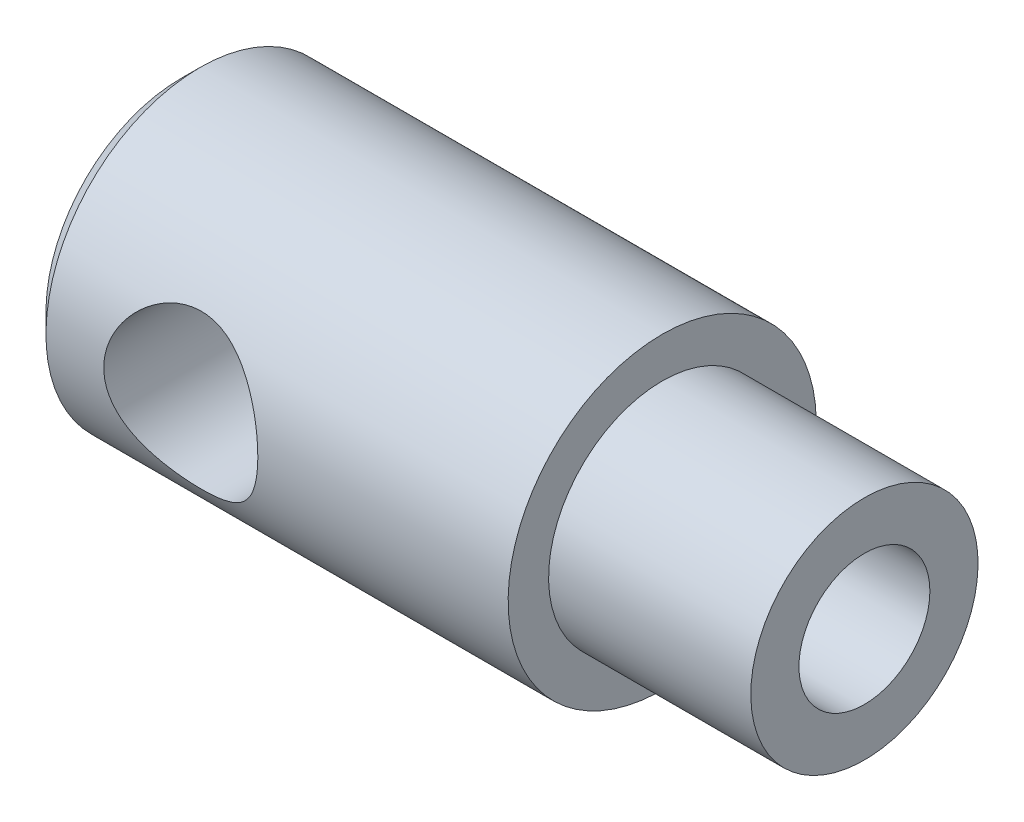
from build123d import *

# Parameters (mm, degrees)
SKETCH2_R             = 4
EXTRUDE1_DEPTH        = 10
M8_TAPPED_HOLE1_D     = 6.8
M8_TAPPED_HOLE1_DEPTH = 27.5
M8_TAPPED_HOLE1_TIP   = 2.042926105


with BuildPart() as part:
    # Sketch1 → Revolve1 (revolve)
    with BuildSketch(Plane.XY):
        Polygon((0, 0), (0, 7), (1, 8), (25, 8), (25, 5.9), (35.5, 5.9), (35.5, 0), align=None)
    revolve(axis=Axis((35.5, 0, 0), (-1, 0, 0)))

    # Sketch2 → Extrude1 (cut, symmetric)
    with BuildSketch(Plane.XY):
        with Locations((8, 0)):
            Circle(SKETCH2_R)
    extrude(amount=EXTRUDE1_DEPTH, both=True, mode=Mode.SUBTRACT)

    # M8 Tapped Hole1
    with Locations(Plane.YZ.offset(35.5)):
        with Locations((0, 0)):
            Hole(M8_TAPPED_HOLE1_D / 2, depth=M8_TAPPED_HOLE1_DEPTH)
            with Locations((0, 0, -(M8_TAPPED_HOLE1_DEPTH + M8_TAPPED_HOLE1_TIP / 2))):  # 118° drill point
                Cone(0, M8_TAPPED_HOLE1_D / 2, M8_TAPPED_HOLE1_TIP, mode=Mode.SUBTRACT)


solid = part.part
